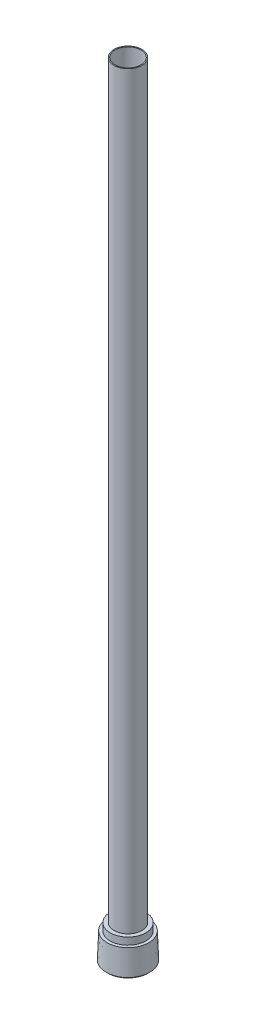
from build123d import *

# Parameters (mm, degrees)
CUT_EXTRUDE2_DEPTH = 7.9248
SKETCH2_R          = 5.0419
CUT_EXTRUDE1_DEPTH = 296.8752
CHAMFER1_SIZE      = 0.508
CHAMFER1_SIZE2     = 0.49045616


with BuildPart() as part:
    # Sketch1 → Revolve1 (revolve)
    with BuildSketch(Plane(origin=(0, 0, 0), x_dir=(0, 0, -1), z_dir=(1, 0, 0)), mode=Mode.PRIVATE) as revolve1_sk:
        Polygon((0, 304.8), (0, 0), (8.4709, 0), (8.09492417, 10.3124), (6.9342, 10.3124), (6.9342, 13.081), (5.4229, 13.081), (5.4229, 304.8), align=None)
    revolve(revolve1_sk.sketch.rotate(Axis((0, 0, 0), (0, -1, 0)), 180), axis=Axis((0, 0, 0), (0, -1, 0)))

    # Sketch3 → Cut-Extrude2 (cut)
    with BuildSketch(Plane(origin=(0, 0, 0), x_dir=(-1, 0, 0), z_dir=(0, -1, 0))):
        Polygon((0, -4.575385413), (3.9624, -2.287692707), (3.9624, 2.287692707), (0, 4.575385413), (-3.9624, 2.287692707), (-3.9624, -2.287692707), align=None)
    extrude(amount=-CUT_EXTRUDE2_DEPTH, mode=Mode.SUBTRACT)

    # Sketch2 → Cut-Extrude1 (cut)
    with BuildSketch(Plane(origin=(0, 304.8, 0), x_dir=(1, 0, 0), z_dir=(0, 1, 0))):
        with Locations(Location((0, 0, 0), (0, 0, 270))):
            Circle(SKETCH2_R)
    extrude(amount=-CUT_EXTRUDE1_DEPTH, mode=Mode.SUBTRACT)

    # Chamfer1
    chamfer1_edges = [part.edges().sort_by_distance(p)[0] for p in [
        (0, 0, -8.4709),
    ]]
    chamfer1_side = [part.faces().sort_by_distance(p)[0] for p in [
        (0, 0, -8.231306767),
    ]]
    chamfer(chamfer1_edges, length=CHAMFER1_SIZE, length2=CHAMFER1_SIZE2, reference=chamfer1_side[0])


solid = part.part
